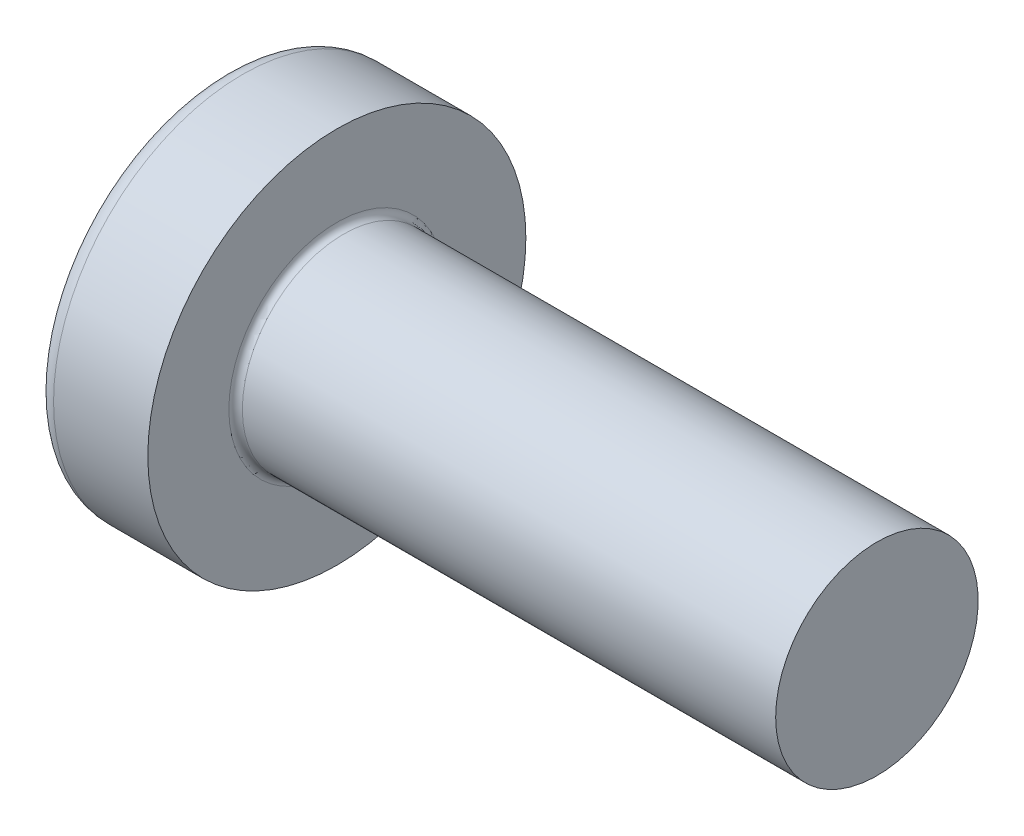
from build123d import *

# Parameters (mm, degrees)
FILLET1_R    = 0.1
RECPAT_COUNT = 2
RECPAT_ANGLE = 90


with BuildPart() as part:
    # BodySke → Base-Revolve (revolve)
    with BuildSketch(Plane.XY, mode=Mode.PRIVATE) as base_revolve_sk:
        with BuildLine():
            Line((2.4, 1.5), (2.4, 2.8))
            Line((2.4, 2.8), (1.003501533, 2.8))
            ThreePointArc((1.003501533, 2.8), (0.873295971, 2.76653015), (0.775371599, 2.674418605))
            ThreePointArc((0.775371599, 2.674418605), (0.197753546, 1.392274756), (0, 0))
            Line((0, 0), (10.4, 0))
            Line((10.4, 0), (10.4, 1.5))
            Line((10.4, 1.5), (2.4, 1.5))
        make_face()
    revolve(base_revolve_sk.sketch.rotate(Axis((1.003501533, 0, 0), (1, 0, 0)), 90), axis=Axis((1.003501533, 0, 0), (1, 0, 0)))

    # Fillet1
    fillet1_edges = [part.edges().sort_by_distance(p)[0] for p in [
        (2.4, 0, -1.5),
    ]]
    fillet(fillet1_edges, radius=FILLET1_R)

    # Sketch3 → Recess section 0
    with BuildSketch(Plane(origin=(0, 0, 0), x_dir=(0, 0, -1), z_dir=(1, 0, 0))):
        with BuildLine():
            Line((0.37, -1.4), (-0.37, -1.4))
            Line((-0.37, -1.4), (-0.37, 1.4))
            Line((-0.37, 1.4), (0.37, 1.4))
            Line((0.37, 1.4), (0.37, -1.4))
        make_face()
    # Sketch4 → Recess section 1
    with BuildSketch(Plane(origin=(1.75, 0, 0), x_dir=(0, 0, -1), z_dir=(1, 0, 0))):
        with BuildLine():
            Line((0.37, -0.527482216), (-0.37, -0.527482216))
            Line((-0.37, -0.527482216), (-0.37, 0.527482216))
            Line((-0.37, 0.527482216), (0.37, 0.527482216))
            Line((0.37, 0.527482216), (0.37, -0.527482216))
        make_face()
    recess = loft(mode=Mode.SUBTRACT)

    # RecPat: Recess ×2 about axis
    recpat_axis = Axis((0, 0, 0), (1, 0, 0))
    for i in range(1, RECPAT_COUNT):
        add(recess.rotate(recpat_axis, i * RECPAT_ANGLE / (RECPAT_COUNT - 1)), mode=Mode.SUBTRACT)

    # RecCorSke → RecessCore (revolve, cut)
    with BuildSketch(Plane.XY, mode=Mode.PRIVATE) as recesscore_sk:
        Polygon((0, 0), (0, 0.678371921), (1.75, 0.556), (1.930655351, 0), align=None)
    revolve(recesscore_sk.sketch.rotate(Axis((-3.175, 0, 0), (1, 0, 0)), 15.814025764), axis=Axis((-3.175, 0, 0), (1, 0, 0)), mode=Mode.SUBTRACT)


solid = part.part
